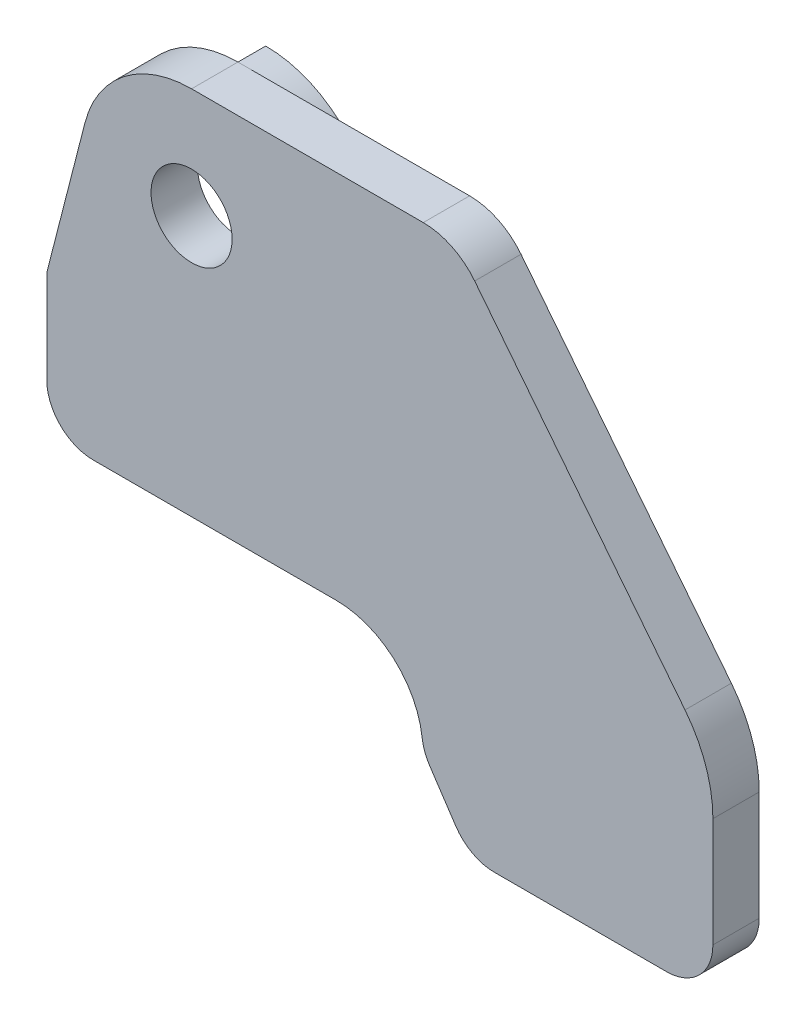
ISO-10303-21;
HEADER;
FILE_DESCRIPTION(('STEP AP214'),'2;1');
FILE_NAME('part.step','',(''),(''),'','','');
FILE_SCHEMA(('AUTOMOTIVE_DESIGN { 1 0 10303 214 1 1 1 1 }'));
ENDSEC;
DATA;
#1=APPLICATION_CONTEXT('core data for automotive mechanical design processes');
#2=APPLICATION_PROTOCOL_DEFINITION('international standard','automotive_design',2000,#1);
#3=PRODUCT_CONTEXT('',#1,'mechanical');
#4=PRODUCT('Part','Part','',(#3));
#5=PRODUCT_RELATED_PRODUCT_CATEGORY('part','',(#4));
#6=PRODUCT_DEFINITION_FORMATION('','',#4);
#7=PRODUCT_DEFINITION_CONTEXT('part definition',#1,'design');
#8=PRODUCT_DEFINITION('design','',#6,#7);
#9=PRODUCT_DEFINITION_SHAPE('','',#8);
#10=(LENGTH_UNIT() NAMED_UNIT(*) SI_UNIT(.MILLI.,.METRE.));
#11=(NAMED_UNIT(*) PLANE_ANGLE_UNIT() SI_UNIT($,.RADIAN.));
#12=(NAMED_UNIT(*) SI_UNIT($,.STERADIAN.) SOLID_ANGLE_UNIT());
#13=UNCERTAINTY_MEASURE_WITH_UNIT(LENGTH_MEASURE(1.E-05),#10,'distance_accuracy_value','');
#14=(GEOMETRIC_REPRESENTATION_CONTEXT(3) GLOBAL_UNCERTAINTY_ASSIGNED_CONTEXT((#13)) GLOBAL_UNIT_ASSIGNED_CONTEXT((#10,
#11,#12)) REPRESENTATION_CONTEXT('',''));
#15=CARTESIAN_POINT('',(0.,0.,0.));
#16=DIRECTION('',(0.,0.,1.));
#17=DIRECTION('',(1.,0.,0.));
#18=AXIS2_PLACEMENT_3D('',#15,#16,#17);
#19=CARTESIAN_POINT('',(0.,0.,2.54));
#20=DIRECTION('',(0.,0.,-1.));
#21=DIRECTION('',(-1.,0.,0.));
#22=AXIS2_PLACEMENT_3D('',#19,#20,#21);
#23=PLANE('',#22);
#24=DIRECTION('',(0.,-1.,0.));
#25=VECTOR('',#24,1.);
#26=CARTESIAN_POINT('',(-7.9375,-6.66373533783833,2.54));
#27=LINE('',#26,#25);
#28=CARTESIAN_POINT('',(-7.9375,-6.66373533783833,2.54));
#29=VERTEX_POINT('',#28);
#30=CARTESIAN_POINT('',(-7.9375,-11.7437353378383,2.54));
#31=VERTEX_POINT('',#30);
#32=EDGE_CURVE('E206',#29,#31,#27,.T.);
#33=ORIENTED_EDGE('',*,*,#32,.T.);
#34=CARTESIAN_POINT('',(-5.3975,-11.7437353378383,2.54));
#35=DIRECTION('',(0.,0.,-1.));
#36=DIRECTION('',(-1.,0.,0.));
#37=AXIS2_PLACEMENT_3D('',#34,#35,#36);
#38=CIRCLE('',#37,2.54);
#39=CARTESIAN_POINT('',(-5.3975,-14.2837353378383,2.54));
#40=VERTEX_POINT('',#39);
#41=EDGE_CURVE('E301',#31,#40,#38,.F.);
#42=ORIENTED_EDGE('',*,*,#41,.T.);
#43=DIRECTION('',(1.,0.,0.));
#44=VECTOR('',#43,1.);
#45=CARTESIAN_POINT('',(-7.9375,-14.2837353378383,2.54));
#46=LINE('',#45,#44);
#47=CARTESIAN_POINT('',(7.9375,-14.2837353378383,2.54));
#48=VERTEX_POINT('',#47);
#49=EDGE_CURVE('E209',#40,#48,#46,.T.);
#50=ORIENTED_EDGE('',*,*,#49,.T.);
#51=CARTESIAN_POINT('',(7.9375,-19.0202003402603,2.54));
#52=DIRECTION('',(0.,0.,-1.));
#53=DIRECTION('',(1.,0.,0.));
#54=AXIS2_PLACEMENT_3D('',#51,#52,#53);
#55=CIRCLE('',#54,4.73646500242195);
#56=CARTESIAN_POINT('',(12.6412554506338,-18.4645157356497,2.54));
#57=VERTEX_POINT('',#56);
#58=EDGE_CURVE('E211',#48,#57,#55,.T.);
#59=ORIENTED_EDGE('',*,*,#58,.T.);
#60=CARTESIAN_POINT('',(15.1637144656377,-18.1665215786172,2.54));
#61=DIRECTION('',(0.,0.,-1.));
#62=DIRECTION('',(-1.,0.,0.));
#63=AXIS2_PLACEMENT_3D('',#60,#61,#62);
#64=CIRCLE('',#63,2.54);
#65=CARTESIAN_POINT('',(13.0503067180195,-19.5754600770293,2.54));
#66=VERTEX_POINT('',#65);
#67=EDGE_CURVE('E295',#57,#66,#64,.F.);
#68=ORIENTED_EDGE('',*,*,#67,.T.);
#69=DIRECTION('',(0.55470019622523,-0.832050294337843,0.));
#70=VECTOR('',#69,1.);
#71=CARTESIAN_POINT('',(15.24,-22.86,2.54));
#72=LINE('',#71,#70);
#73=CARTESIAN_POINT('',(14.4859589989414,-21.7289384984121,2.54));
#74=VERTEX_POINT('',#73);
#75=EDGE_CURVE('E214',#66,#74,#72,.T.);
#76=ORIENTED_EDGE('',*,*,#75,.T.);
#77=CARTESIAN_POINT('',(16.5993667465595,-20.32,2.54));
#78=DIRECTION('',(0.,0.,-1.));
#79=DIRECTION('',(-1.,0.,0.));
#80=AXIS2_PLACEMENT_3D('',#77,#78,#79);
#81=CIRCLE('',#80,2.54);
#82=CARTESIAN_POINT('',(16.5993667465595,-22.86,2.54));
#83=VERTEX_POINT('',#82);
#84=EDGE_CURVE('E297',#74,#83,#81,.F.);
#85=ORIENTED_EDGE('',*,*,#84,.T.);
#86=DIRECTION('',(1.,0.,0.));
#87=VECTOR('',#86,1.);
#88=CARTESIAN_POINT('',(28.575,-22.86,2.54));
#89=LINE('',#88,#87);
#90=CARTESIAN_POINT('',(26.035,-22.86,2.54));
#91=VERTEX_POINT('',#90);
#92=EDGE_CURVE('E217',#83,#91,#89,.T.);
#93=ORIENTED_EDGE('',*,*,#92,.T.);
#94=CARTESIAN_POINT('',(26.035,-20.32,2.54));
#95=DIRECTION('',(0.,0.,-1.));
#96=DIRECTION('',(-1.,0.,0.));
#97=AXIS2_PLACEMENT_3D('',#94,#95,#96);
#98=CIRCLE('',#97,2.54);
#99=CARTESIAN_POINT('',(28.575,-20.32,2.54));
#100=VERTEX_POINT('',#99);
#101=EDGE_CURVE('E299',#91,#100,#98,.F.);
#102=ORIENTED_EDGE('',*,*,#101,.T.);
#103=DIRECTION('',(0.,1.,0.));
#104=VECTOR('',#103,1.);
#105=CARTESIAN_POINT('',(28.575,-14.3271596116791,2.54));
#106=LINE('',#105,#104);
#107=CARTESIAN_POINT('',(28.575,-14.3271596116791,2.54));
#108=VERTEX_POINT('',#107);
#109=EDGE_CURVE('E220',#100,#108,#106,.T.);
#110=ORIENTED_EDGE('',*,*,#109,.T.);
#111=CARTESIAN_POINT('',(21.4793651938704,-14.3271596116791,2.54));
#112=DIRECTION('',(0.,0.,1.));
#113=DIRECTION('',(-1.,0.,0.));
#114=AXIS2_PLACEMENT_3D('',#111,#112,#113);
#115=CIRCLE('',#114,7.09563480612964);
#116=CARTESIAN_POINT('',(27.0474761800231,-9.92895846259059,2.54));
#117=VERTEX_POINT('',#116);
#118=EDGE_CURVE('E222',#108,#117,#115,.T.);
#119=ORIENTED_EDGE('',*,*,#118,.T.);
#120=DIRECTION('',(-0.619846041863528,0.784723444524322,0.));
#121=VECTOR('',#120,1.);
#122=CARTESIAN_POINT('',(15.5179856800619,4.6673459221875,2.54));
#123=LINE('',#122,#121);
#124=CARTESIAN_POINT('',(15.5179856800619,4.6673459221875,2.54));
#125=VERTEX_POINT('',#124);
#126=EDGE_CURVE('E224',#117,#125,#123,.T.);
#127=ORIENTED_EDGE('',*,*,#126,.T.);
#128=CARTESIAN_POINT('',(12.7,2.44144419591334,2.54));
#129=DIRECTION('',(0.,0.,1.));
#130=DIRECTION('',(-1.,0.,0.));
#131=AXIS2_PLACEMENT_3D('',#128,#129,#130);
#132=CIRCLE('',#131,3.59105580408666);
#133=CARTESIAN_POINT('',(12.7,6.0325,2.54));
#134=VERTEX_POINT('',#133);
#135=EDGE_CURVE('E226',#125,#134,#132,.T.);
#136=ORIENTED_EDGE('',*,*,#135,.T.);
#137=DIRECTION('',(-1.,0.,0.));
#138=VECTOR('',#137,1.);
#139=CARTESIAN_POINT('',(0.,6.0325,2.54));
#140=LINE('',#139,#138);
#141=CARTESIAN_POINT('',(0.,6.0325,2.54));
#142=VERTEX_POINT('',#141);
#143=EDGE_CURVE('E228',#134,#142,#140,.T.);
#144=ORIENTED_EDGE('',*,*,#143,.T.);
#145=CARTESIAN_POINT('',(0.,0.,2.54));
#146=DIRECTION('',(0.,0.,1.));
#147=DIRECTION('',(-1.,0.,0.));
#148=AXIS2_PLACEMENT_3D('',#145,#146,#147);
#149=CIRCLE('',#148,6.0325);
#150=CARTESIAN_POINT('',(-5.84325813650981,1.49912994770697,2.54));
#151=VERTEX_POINT('',#150);
#152=EDGE_CURVE('E200',#142,#151,#149,.T.);
#153=ORIENTED_EDGE('',*,*,#152,.T.);
#154=DIRECTION('',(-0.248508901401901,-0.968629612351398,0.));
#155=VECTOR('',#154,1.);
#156=CARTESIAN_POINT('',(-5.84325813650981,1.49912994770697,2.54));
#157=LINE('',#156,#155);
#158=EDGE_CURVE('E203',#151,#29,#157,.T.);
#159=ORIENTED_EDGE('',*,*,#158,.T.);
#160=EDGE_LOOP('',(#33,#42,#50,#59,#68,#76,#85,#93,#102,#110,#119,#127,#136,#144,#153,#159));
#161=FACE_BOUND('',#160,.T.);
#162=CARTESIAN_POINT('',(0.,0.,2.54));
#163=DIRECTION('',(0.,0.,1.));
#164=DIRECTION('',(1.,0.,0.));
#165=AXIS2_PLACEMENT_3D('',#162,#163,#164);
#166=CIRCLE('',#165,2.2225);
#167=CARTESIAN_POINT('',(2.2225,0.,2.54));
#168=VERTEX_POINT('',#167);
#169=EDGE_CURVE('E191',#168,#168,#166,.T.);
#170=ORIENTED_EDGE('',*,*,#169,.F.);
#171=EDGE_LOOP('',(#170));
#172=FACE_BOUND('',#171,.T.);
#173=ADVANCED_FACE('F33',(#161,#172),#23,.F.);
#174=CARTESIAN_POINT('',(0.,0.,0.));
#175=DIRECTION('',(0.,0.,-1.));
#176=DIRECTION('',(-1.,0.,0.));
#177=AXIS2_PLACEMENT_3D('',#174,#175,#176);
#178=PLANE('',#177);
#179=CARTESIAN_POINT('',(0.,0.,0.));
#180=DIRECTION('',(0.,0.,-1.));
#181=DIRECTION('',(1.,0.,0.));
#182=AXIS2_PLACEMENT_3D('',#179,#180,#181);
#183=CIRCLE('',#182,6.0325);
#184=CARTESIAN_POINT('',(0.,6.0325,0.));
#185=VERTEX_POINT('',#184);
#186=CARTESIAN_POINT('',(6.00536793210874,0.571499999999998,0.));
#187=VERTEX_POINT('',#186);
#188=EDGE_CURVE('E187',#185,#187,#183,.T.);
#189=ORIENTED_EDGE('',*,*,#188,.F.);
#190=DIRECTION('',(-1.,0.,0.));
#191=VECTOR('',#190,1.);
#192=CARTESIAN_POINT('',(0.,6.0325,0.));
#193=LINE('',#192,#191);
#194=CARTESIAN_POINT('',(12.7,6.0325,0.));
#195=VERTEX_POINT('',#194);
#196=EDGE_CURVE('E204',#195,#185,#193,.T.);
#197=ORIENTED_EDGE('',*,*,#196,.F.);
#198=CARTESIAN_POINT('',(12.7,2.44144419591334,0.));
#199=DIRECTION('',(0.,0.,1.));
#200=DIRECTION('',(-1.,0.,0.));
#201=AXIS2_PLACEMENT_3D('',#198,#199,#200);
#202=CIRCLE('',#201,3.59105580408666);
#203=CARTESIAN_POINT('',(15.5179856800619,4.6673459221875,0.));
#204=VERTEX_POINT('',#203);
#205=EDGE_CURVE('E255',#204,#195,#202,.T.);
#206=ORIENTED_EDGE('',*,*,#205,.F.);
#207=DIRECTION('',(-0.619846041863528,0.784723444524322,0.));
#208=VECTOR('',#207,1.);
#209=CARTESIAN_POINT('',(15.5179856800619,4.6673459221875,0.));
#210=LINE('',#209,#208);
#211=CARTESIAN_POINT('',(27.0474761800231,-9.92895846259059,0.));
#212=VERTEX_POINT('',#211);
#213=EDGE_CURVE('E253',#212,#204,#210,.T.);
#214=ORIENTED_EDGE('',*,*,#213,.F.);
#215=CARTESIAN_POINT('',(21.4793651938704,-14.3271596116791,0.));
#216=DIRECTION('',(0.,0.,1.));
#217=DIRECTION('',(-1.,0.,0.));
#218=AXIS2_PLACEMENT_3D('',#215,#216,#217);
#219=CIRCLE('',#218,7.09563480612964);
#220=CARTESIAN_POINT('',(28.575,-14.3271596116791,0.));
#221=VERTEX_POINT('',#220);
#222=EDGE_CURVE('E251',#221,#212,#219,.T.);
#223=ORIENTED_EDGE('',*,*,#222,.F.);
#224=DIRECTION('',(0.,1.,0.));
#225=VECTOR('',#224,1.);
#226=CARTESIAN_POINT('',(28.575,-14.3271596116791,0.));
#227=LINE('',#226,#225);
#228=CARTESIAN_POINT('',(28.575,-20.32,0.));
#229=VERTEX_POINT('',#228);
#230=EDGE_CURVE('E249',#229,#221,#227,.T.);
#231=ORIENTED_EDGE('',*,*,#230,.F.);
#232=CARTESIAN_POINT('',(26.035,-20.32,0.));
#233=DIRECTION('',(0.,0.,-1.));
#234=DIRECTION('',(-1.,0.,0.));
#235=AXIS2_PLACEMENT_3D('',#232,#233,#234);
#236=CIRCLE('',#235,2.54);
#237=CARTESIAN_POINT('',(26.035,-22.86,0.));
#238=VERTEX_POINT('',#237);
#239=EDGE_CURVE('E289',#229,#238,#236,.T.);
#240=ORIENTED_EDGE('',*,*,#239,.T.);
#241=DIRECTION('',(1.,0.,0.));
#242=VECTOR('',#241,1.);
#243=CARTESIAN_POINT('',(28.575,-22.86,0.));
#244=LINE('',#243,#242);
#245=CARTESIAN_POINT('',(16.5993667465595,-22.86,0.));
#246=VERTEX_POINT('',#245);
#247=EDGE_CURVE('E246',#246,#238,#244,.T.);
#248=ORIENTED_EDGE('',*,*,#247,.F.);
#249=CARTESIAN_POINT('',(16.5993667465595,-20.32,0.));
#250=DIRECTION('',(0.,0.,-1.));
#251=DIRECTION('',(-1.,0.,0.));
#252=AXIS2_PLACEMENT_3D('',#249,#250,#251);
#253=CIRCLE('',#252,2.54);
#254=CARTESIAN_POINT('',(14.4859589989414,-21.7289384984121,0.));
#255=VERTEX_POINT('',#254);
#256=EDGE_CURVE('E287',#246,#255,#253,.T.);
#257=ORIENTED_EDGE('',*,*,#256,.T.);
#258=DIRECTION('',(0.55470019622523,-0.832050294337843,0.));
#259=VECTOR('',#258,1.);
#260=CARTESIAN_POINT('',(15.24,-22.86,0.));
#261=LINE('',#260,#259);
#262=CARTESIAN_POINT('',(13.0503067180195,-19.5754600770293,0.));
#263=VERTEX_POINT('',#262);
#264=EDGE_CURVE('E243',#263,#255,#261,.T.);
#265=ORIENTED_EDGE('',*,*,#264,.F.);
#266=CARTESIAN_POINT('',(15.1637144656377,-18.1665215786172,0.));
#267=DIRECTION('',(0.,0.,-1.));
#268=DIRECTION('',(-1.,0.,0.));
#269=AXIS2_PLACEMENT_3D('',#266,#267,#268);
#270=CIRCLE('',#269,2.54);
#271=CARTESIAN_POINT('',(12.6412554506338,-18.4645157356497,0.));
#272=VERTEX_POINT('',#271);
#273=EDGE_CURVE('E285',#263,#272,#270,.T.);
#274=ORIENTED_EDGE('',*,*,#273,.T.);
#275=CARTESIAN_POINT('',(7.9375,-19.0202003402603,0.));
#276=DIRECTION('',(0.,0.,-1.));
#277=DIRECTION('',(1.,0.,0.));
#278=AXIS2_PLACEMENT_3D('',#275,#276,#277);
#279=CIRCLE('',#278,4.73646500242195);
#280=CARTESIAN_POINT('',(7.9375,-14.2837353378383,0.));
#281=VERTEX_POINT('',#280);
#282=EDGE_CURVE('E240',#281,#272,#279,.T.);
#283=ORIENTED_EDGE('',*,*,#282,.F.);
#284=DIRECTION('',(1.,0.,0.));
#285=VECTOR('',#284,1.);
#286=CARTESIAN_POINT('',(-7.9375,-14.2837353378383,0.));
#287=LINE('',#286,#285);
#288=CARTESIAN_POINT('',(-5.3975,-14.2837353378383,0.));
#289=VERTEX_POINT('',#288);
#290=EDGE_CURVE('E238',#289,#281,#287,.T.);
#291=ORIENTED_EDGE('',*,*,#290,.F.);
#292=CARTESIAN_POINT('',(-5.3975,-11.7437353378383,0.));
#293=DIRECTION('',(0.,0.,-1.));
#294=DIRECTION('',(-1.,0.,0.));
#295=AXIS2_PLACEMENT_3D('',#292,#293,#294);
#296=CIRCLE('',#295,2.54);
#297=CARTESIAN_POINT('',(-7.9375,-11.7437353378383,0.));
#298=VERTEX_POINT('',#297);
#299=EDGE_CURVE('E291',#289,#298,#296,.T.);
#300=ORIENTED_EDGE('',*,*,#299,.T.);
#301=DIRECTION('',(0.,-1.,0.));
#302=VECTOR('',#301,1.);
#303=CARTESIAN_POINT('',(-7.9375,-6.66373533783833,0.));
#304=LINE('',#303,#302);
#305=CARTESIAN_POINT('',(-7.9375,-6.66373533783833,0.));
#306=VERTEX_POINT('',#305);
#307=EDGE_CURVE('E235',#306,#298,#304,.T.);
#308=ORIENTED_EDGE('',*,*,#307,.F.);
#309=DIRECTION('',(-0.248508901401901,-0.968629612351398,0.));
#310=VECTOR('',#309,1.);
#311=CARTESIAN_POINT('',(-5.84325813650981,1.49912994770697,0.));
#312=LINE('',#311,#310);
#313=CARTESIAN_POINT('',(-5.84325813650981,1.49912994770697,0.));
#314=VERTEX_POINT('',#313);
#315=EDGE_CURVE('E233',#314,#306,#312,.T.);
#316=ORIENTED_EDGE('',*,*,#315,.F.);
#317=CARTESIAN_POINT('',(0.,0.,0.));
#318=DIRECTION('',(0.,0.,1.));
#319=DIRECTION('',(-1.,0.,0.));
#320=AXIS2_PLACEMENT_3D('',#317,#318,#319);
#321=CIRCLE('',#320,6.0325);
#322=EDGE_CURVE('E198',#185,#314,#321,.T.);
#323=ORIENTED_EDGE('',*,*,#322,.F.);
#324=DIRECTION('',(0.,1.,0.));
#325=VECTOR('',#324,1.);
#326=CARTESIAN_POINT('',(0.,6.0325,0.));
#327=LINE('',#326,#325);
#328=CARTESIAN_POINT('',(0.,3.26563206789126,0.));
#329=VERTEX_POINT('',#328);
#330=EDGE_CURVE('E48',#329,#185,#327,.T.);
#331=ORIENTED_EDGE('',*,*,#330,.F.);
#332=CARTESIAN_POINT('',(0.0437653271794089,0.0247438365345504,0.));
#333=DIRECTION('',(0.,0.,1.));
#334=DIRECTION('',(-1.,0.,0.));
#335=AXIS2_PLACEMENT_3D('',#332,#333,#334);
#336=CIRCLE('',#335,3.24118372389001);
#337=CARTESIAN_POINT('',(3.2385,0.571499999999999,0.));
#338=VERTEX_POINT('',#337);
#339=EDGE_CURVE('E515',#338,#329,#336,.T.);
#340=ORIENTED_EDGE('',*,*,#339,.F.);
#341=DIRECTION('',(-1.,0.,0.));
#342=VECTOR('',#341,1.);
#343=CARTESIAN_POINT('',(3.2385,0.571499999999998,0.));
#344=LINE('',#343,#342);
#345=EDGE_CURVE('E54',#187,#338,#344,.T.);
#346=ORIENTED_EDGE('',*,*,#345,.F.);
#347=EDGE_LOOP('',(#189,#197,#206,#214,#223,#231,#240,#248,#257,#265,#274,#283,#291,#300,#308,
#316,#323,#331,#340,#346));
#348=FACE_BOUND('',#347,.T.);
#349=CARTESIAN_POINT('',(0.,0.,0.));
#350=DIRECTION('',(0.,0.,1.));
#351=DIRECTION('',(1.,0.,0.));
#352=AXIS2_PLACEMENT_3D('',#349,#350,#351);
#353=CIRCLE('',#352,2.2225);
#354=CARTESIAN_POINT('',(2.2225,0.,0.));
#355=VERTEX_POINT('',#354);
#356=EDGE_CURVE('E188',#355,#355,#353,.T.);
#357=ORIENTED_EDGE('',*,*,#356,.T.);
#358=EDGE_LOOP('',(#357));
#359=FACE_BOUND('',#358,.T.);
#360=ADVANCED_FACE('F331',(#348,#359),#178,.T.);
#361=CARTESIAN_POINT('',(0.,0.,2.54));
#362=DIRECTION('',(0.,0.,-1.));
#363=DIRECTION('',(-1.,0.,0.));
#364=AXIS2_PLACEMENT_3D('',#361,#362,#363);
#365=CYLINDRICAL_SURFACE('',#364,6.0325);
#366=ORIENTED_EDGE('',*,*,#322,.T.);
#367=DIRECTION('',(0.,0.,-1.));
#368=VECTOR('',#367,1.);
#369=CARTESIAN_POINT('',(-5.84325813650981,1.49912994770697,2.54));
#370=LINE('',#369,#368);
#371=EDGE_CURVE('E279',#151,#314,#370,.T.);
#372=ORIENTED_EDGE('',*,*,#371,.F.);
#373=ORIENTED_EDGE('',*,*,#152,.F.);
#374=DIRECTION('',(0.,0.,-1.));
#375=VECTOR('',#374,1.);
#376=CARTESIAN_POINT('',(0.,6.0325,2.54));
#377=LINE('',#376,#375);
#378=EDGE_CURVE('E230',#142,#185,#377,.T.);
#379=ORIENTED_EDGE('',*,*,#378,.T.);
#380=EDGE_LOOP('',(#366,#372,#373,#379));
#381=FACE_BOUND('',#380,.T.);
#382=ADVANCED_FACE('F365',(#381),#365,.T.);
#383=CARTESIAN_POINT('',(-5.84325813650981,1.49912994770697,2.54));
#384=DIRECTION('',(0.968629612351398,-0.248508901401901,0.));
#385=DIRECTION('',(0.248508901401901,0.968629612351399,0.));
#386=AXIS2_PLACEMENT_3D('',#383,#384,#385);
#387=PLANE('',#386);
#388=ORIENTED_EDGE('',*,*,#315,.T.);
#389=DIRECTION('',(0.,0.,-1.));
#390=VECTOR('',#389,1.);
#391=CARTESIAN_POINT('',(-7.9375,-6.66373533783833,2.54));
#392=LINE('',#391,#390);
#393=EDGE_CURVE('E276',#29,#306,#392,.T.);
#394=ORIENTED_EDGE('',*,*,#393,.F.);
#395=ORIENTED_EDGE('',*,*,#158,.F.);
#396=ORIENTED_EDGE('',*,*,#371,.T.);
#397=EDGE_LOOP('',(#388,#394,#395,#396));
#398=FACE_BOUND('',#397,.T.);
#399=ADVANCED_FACE('F367',(#398),#387,.F.);
#400=CARTESIAN_POINT('',(-7.9375,-6.66373533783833,2.54));
#401=DIRECTION('',(1.,0.,0.));
#402=DIRECTION('',(0.,0.,-1.));
#403=AXIS2_PLACEMENT_3D('',#400,#401,#402);
#404=PLANE('',#403);
#405=ORIENTED_EDGE('',*,*,#307,.T.);
#406=DIRECTION('',(0.,0.,-1.));
#407=VECTOR('',#406,1.);
#408=CARTESIAN_POINT('',(-7.9375,-11.7437353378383,2.54));
#409=LINE('',#408,#407);
#410=EDGE_CURVE('E293',#298,#31,#409,.F.);
#411=ORIENTED_EDGE('',*,*,#410,.T.);
#412=ORIENTED_EDGE('',*,*,#32,.F.);
#413=ORIENTED_EDGE('',*,*,#393,.T.);
#414=EDGE_LOOP('',(#405,#411,#412,#413));
#415=FACE_BOUND('',#414,.T.);
#416=ADVANCED_FACE('F421',(#415),#404,.F.);
#417=CARTESIAN_POINT('',(-7.9375,-14.2837353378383,2.54));
#418=DIRECTION('',(0.,1.,0.));
#419=DIRECTION('',(0.,0.,1.));
#420=AXIS2_PLACEMENT_3D('',#417,#418,#419);
#421=PLANE('',#420);
#422=ORIENTED_EDGE('',*,*,#49,.F.);
#423=DIRECTION('',(0.,0.,-1.));
#424=VECTOR('',#423,1.);
#425=CARTESIAN_POINT('',(-5.3975,-14.2837353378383,2.54));
#426=LINE('',#425,#424);
#427=EDGE_CURVE('E282',#40,#289,#426,.T.);
#428=ORIENTED_EDGE('',*,*,#427,.T.);
#429=ORIENTED_EDGE('',*,*,#290,.T.);
#430=DIRECTION('',(0.,0.,-1.));
#431=VECTOR('',#430,1.);
#432=CARTESIAN_POINT('',(7.9375,-14.2837353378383,2.54));
#433=LINE('',#432,#431);
#434=EDGE_CURVE('E273',#48,#281,#433,.T.);
#435=ORIENTED_EDGE('',*,*,#434,.F.);
#436=EDGE_LOOP('',(#422,#428,#429,#435));
#437=FACE_BOUND('',#436,.T.);
#438=ADVANCED_FACE('F379',(#437),#421,.F.);
#439=CARTESIAN_POINT('',(7.9375,-19.0202003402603,2.54));
#440=DIRECTION('',(0.,0.,-1.));
#441=DIRECTION('',(-1.,0.,0.));
#442=AXIS2_PLACEMENT_3D('',#439,#440,#441);
#443=CYLINDRICAL_SURFACE('',#442,4.73646500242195);
#444=ORIENTED_EDGE('',*,*,#282,.T.);
#445=DIRECTION('',(0.,0.,-1.));
#446=VECTOR('',#445,1.);
#447=CARTESIAN_POINT('',(12.6412554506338,-18.4645157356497,2.54));
#448=LINE('',#447,#446);
#449=EDGE_CURVE('E11',#272,#57,#448,.F.);
#450=ORIENTED_EDGE('',*,*,#449,.T.);
#451=ORIENTED_EDGE('',*,*,#58,.F.);
#452=ORIENTED_EDGE('',*,*,#434,.T.);
#453=EDGE_LOOP('',(#444,#450,#451,#452));
#454=FACE_BOUND('',#453,.T.);
#455=ADVANCED_FACE('F385',(#454),#443,.F.);
#456=CARTESIAN_POINT('',(15.24,-22.86,2.54));
#457=DIRECTION('',(0.832050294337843,0.55470019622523,0.));
#458=DIRECTION('',(-0.55470019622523,0.832050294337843,0.));
#459=AXIS2_PLACEMENT_3D('',#456,#457,#458);
#460=PLANE('',#459);
#461=ORIENTED_EDGE('',*,*,#264,.T.);
#462=DIRECTION('',(0.,0.,-1.));
#463=VECTOR('',#462,1.);
#464=CARTESIAN_POINT('',(14.4859589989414,-21.7289384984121,2.54));
#465=LINE('',#464,#463);
#466=EDGE_CURVE('E41',#255,#74,#465,.F.);
#467=ORIENTED_EDGE('',*,*,#466,.T.);
#468=ORIENTED_EDGE('',*,*,#75,.F.);
#469=DIRECTION('',(0.,0.,-1.));
#470=VECTOR('',#469,1.);
#471=CARTESIAN_POINT('',(13.0503067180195,-19.5754600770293,2.54));
#472=LINE('',#471,#470);
#473=EDGE_CURVE('E311',#66,#263,#472,.T.);
#474=ORIENTED_EDGE('',*,*,#473,.T.);
#475=EDGE_LOOP('',(#461,#467,#468,#474));
#476=FACE_BOUND('',#475,.T.);
#477=ADVANCED_FACE('F316',(#476),#460,.F.);
#478=CARTESIAN_POINT('',(28.575,-22.86,2.54));
#479=DIRECTION('',(0.,1.,0.));
#480=DIRECTION('',(0.,0.,1.));
#481=AXIS2_PLACEMENT_3D('',#478,#479,#480);
#482=PLANE('',#481);
#483=ORIENTED_EDGE('',*,*,#247,.T.);
#484=DIRECTION('',(0.,0.,-1.));
#485=VECTOR('',#484,1.);
#486=CARTESIAN_POINT('',(26.035,-22.86,2.54));
#487=LINE('',#486,#485);
#488=EDGE_CURVE('E309',#238,#91,#487,.F.);
#489=ORIENTED_EDGE('',*,*,#488,.T.);
#490=ORIENTED_EDGE('',*,*,#92,.F.);
#491=DIRECTION('',(0.,0.,-1.));
#492=VECTOR('',#491,1.);
#493=CARTESIAN_POINT('',(16.5993667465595,-22.86,2.54));
#494=LINE('',#493,#492);
#495=EDGE_CURVE('E306',#83,#246,#494,.T.);
#496=ORIENTED_EDGE('',*,*,#495,.T.);
#497=EDGE_LOOP('',(#483,#489,#490,#496));
#498=FACE_BOUND('',#497,.T.);
#499=ADVANCED_FACE('F329',(#498),#482,.F.);
#500=CARTESIAN_POINT('',(28.575,-14.3271596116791,2.54));
#501=DIRECTION('',(-1.,0.,0.));
#502=DIRECTION('',(0.,0.,1.));
#503=AXIS2_PLACEMENT_3D('',#500,#501,#502);
#504=PLANE('',#503);
#505=ORIENTED_EDGE('',*,*,#109,.F.);
#506=DIRECTION('',(0.,0.,-1.));
#507=VECTOR('',#506,1.);
#508=CARTESIAN_POINT('',(28.575,-20.32,2.54));
#509=LINE('',#508,#507);
#510=EDGE_CURVE('E303',#100,#229,#509,.T.);
#511=ORIENTED_EDGE('',*,*,#510,.T.);
#512=ORIENTED_EDGE('',*,*,#230,.T.);
#513=DIRECTION('',(0.,0.,-1.));
#514=VECTOR('',#513,1.);
#515=CARTESIAN_POINT('',(28.575,-14.3271596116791,2.54));
#516=LINE('',#515,#514);
#517=EDGE_CURVE('E270',#108,#221,#516,.T.);
#518=ORIENTED_EDGE('',*,*,#517,.F.);
#519=EDGE_LOOP('',(#505,#511,#512,#518));
#520=FACE_BOUND('',#519,.T.);
#521=ADVANCED_FACE('F341',(#520),#504,.F.);
#522=CARTESIAN_POINT('',(21.4793651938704,-14.3271596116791,2.54));
#523=DIRECTION('',(0.,0.,-1.));
#524=DIRECTION('',(-1.,0.,0.));
#525=AXIS2_PLACEMENT_3D('',#522,#523,#524);
#526=CYLINDRICAL_SURFACE('',#525,7.09563480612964);
#527=ORIENTED_EDGE('',*,*,#222,.T.);
#528=DIRECTION('',(0.,0.,-1.));
#529=VECTOR('',#528,1.);
#530=CARTESIAN_POINT('',(27.0474761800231,-9.92895846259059,2.54));
#531=LINE('',#530,#529);
#532=EDGE_CURVE('E267',#117,#212,#531,.T.);
#533=ORIENTED_EDGE('',*,*,#532,.F.);
#534=ORIENTED_EDGE('',*,*,#118,.F.);
#535=ORIENTED_EDGE('',*,*,#517,.T.);
#536=EDGE_LOOP('',(#527,#533,#534,#535));
#537=FACE_BOUND('',#536,.T.);
#538=ADVANCED_FACE('F348',(#537),#526,.T.);
#539=CARTESIAN_POINT('',(15.5179856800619,4.6673459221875,2.54));
#540=DIRECTION('',(-0.784723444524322,-0.619846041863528,0.));
#541=DIRECTION('',(0.619846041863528,-0.784723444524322,0.));
#542=AXIS2_PLACEMENT_3D('',#539,#540,#541);
#543=PLANE('',#542);
#544=ORIENTED_EDGE('',*,*,#213,.T.);
#545=DIRECTION('',(0.,0.,-1.));
#546=VECTOR('',#545,1.);
#547=CARTESIAN_POINT('',(15.5179856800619,4.6673459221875,2.54));
#548=LINE('',#547,#546);
#549=EDGE_CURVE('E264',#125,#204,#548,.T.);
#550=ORIENTED_EDGE('',*,*,#549,.F.);
#551=ORIENTED_EDGE('',*,*,#126,.F.);
#552=ORIENTED_EDGE('',*,*,#532,.T.);
#553=EDGE_LOOP('',(#544,#550,#551,#552));
#554=FACE_BOUND('',#553,.T.);
#555=ADVANCED_FACE('F351',(#554),#543,.F.);
#556=CARTESIAN_POINT('',(12.7,2.44144419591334,2.54));
#557=DIRECTION('',(0.,0.,-1.));
#558=DIRECTION('',(-1.,0.,0.));
#559=AXIS2_PLACEMENT_3D('',#556,#557,#558);
#560=CYLINDRICAL_SURFACE('',#559,3.59105580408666);
#561=ORIENTED_EDGE('',*,*,#205,.T.);
#562=DIRECTION('',(0.,0.,-1.));
#563=VECTOR('',#562,1.);
#564=CARTESIAN_POINT('',(12.7,6.0325,2.54));
#565=LINE('',#564,#563);
#566=EDGE_CURVE('E261',#134,#195,#565,.T.);
#567=ORIENTED_EDGE('',*,*,#566,.F.);
#568=ORIENTED_EDGE('',*,*,#135,.F.);
#569=ORIENTED_EDGE('',*,*,#549,.T.);
#570=EDGE_LOOP('',(#561,#567,#568,#569));
#571=FACE_BOUND('',#570,.T.);
#572=ADVANCED_FACE('F356',(#571),#560,.T.);
#573=CARTESIAN_POINT('',(0.,6.0325,2.54));
#574=DIRECTION('',(0.,-1.,0.));
#575=DIRECTION('',(0.,0.,-1.));
#576=AXIS2_PLACEMENT_3D('',#573,#574,#575);
#577=PLANE('',#576);
#578=ORIENTED_EDGE('',*,*,#196,.T.);
#579=ORIENTED_EDGE('',*,*,#378,.F.);
#580=ORIENTED_EDGE('',*,*,#143,.F.);
#581=ORIENTED_EDGE('',*,*,#566,.T.);
#582=EDGE_LOOP('',(#578,#579,#580,#581));
#583=FACE_BOUND('',#582,.T.);
#584=ADVANCED_FACE('F362',(#583),#577,.F.);
#585=CARTESIAN_POINT('',(0.,0.,2.54));
#586=DIRECTION('',(0.,0.,-1.));
#587=DIRECTION('',(-1.,0.,0.));
#588=AXIS2_PLACEMENT_3D('',#585,#586,#587);
#589=CYLINDRICAL_SURFACE('',#588,2.2225);
#590=ORIENTED_EDGE('',*,*,#169,.T.);
#591=EDGE_LOOP('',(#590));
#592=FACE_BOUND('',#591,.T.);
#593=ORIENTED_EDGE('',*,*,#356,.F.);
#594=EDGE_LOOP('',(#593));
#595=FACE_BOUND('',#594,.T.);
#596=ADVANCED_FACE('F401',(#592,#595),#589,.F.);
#597=CARTESIAN_POINT('',(-5.3975,-11.7437353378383,2.54));
#598=DIRECTION('',(0.,0.,-1.));
#599=DIRECTION('',(-1.,0.,0.));
#600=AXIS2_PLACEMENT_3D('',#597,#598,#599);
#601=CYLINDRICAL_SURFACE('',#600,2.54);
#602=ORIENTED_EDGE('',*,*,#41,.F.);
#603=ORIENTED_EDGE('',*,*,#410,.F.);
#604=ORIENTED_EDGE('',*,*,#299,.F.);
#605=ORIENTED_EDGE('',*,*,#427,.F.);
#606=EDGE_LOOP('',(#602,#603,#604,#605));
#607=FACE_BOUND('',#606,.T.);
#608=ADVANCED_FACE('F376',(#607),#601,.T.);
#609=CARTESIAN_POINT('',(26.035,-20.32,2.54));
#610=DIRECTION('',(0.,0.,-1.));
#611=DIRECTION('',(-1.,0.,0.));
#612=AXIS2_PLACEMENT_3D('',#609,#610,#611);
#613=CYLINDRICAL_SURFACE('',#612,2.54);
#614=ORIENTED_EDGE('',*,*,#101,.F.);
#615=ORIENTED_EDGE('',*,*,#488,.F.);
#616=ORIENTED_EDGE('',*,*,#239,.F.);
#617=ORIENTED_EDGE('',*,*,#510,.F.);
#618=EDGE_LOOP('',(#614,#615,#616,#617));
#619=FACE_BOUND('',#618,.T.);
#620=ADVANCED_FACE('F338',(#619),#613,.T.);
#621=CARTESIAN_POINT('',(16.5993667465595,-20.32,2.54));
#622=DIRECTION('',(0.,0.,-1.));
#623=DIRECTION('',(-1.,0.,0.));
#624=AXIS2_PLACEMENT_3D('',#621,#622,#623);
#625=CYLINDRICAL_SURFACE('',#624,2.54);
#626=ORIENTED_EDGE('',*,*,#84,.F.);
#627=ORIENTED_EDGE('',*,*,#466,.F.);
#628=ORIENTED_EDGE('',*,*,#256,.F.);
#629=ORIENTED_EDGE('',*,*,#495,.F.);
#630=EDGE_LOOP('',(#626,#627,#628,#629));
#631=FACE_BOUND('',#630,.T.);
#632=ADVANCED_FACE('F326',(#631),#625,.T.);
#633=CARTESIAN_POINT('',(15.1637144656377,-18.1665215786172,2.54));
#634=DIRECTION('',(0.,0.,-1.));
#635=DIRECTION('',(-1.,0.,0.));
#636=AXIS2_PLACEMENT_3D('',#633,#634,#635);
#637=CYLINDRICAL_SURFACE('',#636,2.54);
#638=ORIENTED_EDGE('',*,*,#67,.F.);
#639=ORIENTED_EDGE('',*,*,#449,.F.);
#640=ORIENTED_EDGE('',*,*,#273,.F.);
#641=ORIENTED_EDGE('',*,*,#473,.F.);
#642=EDGE_LOOP('',(#638,#639,#640,#641));
#643=FACE_BOUND('',#642,.T.);
#644=ADVANCED_FACE('F35',(#643),#637,.T.);
#645=CARTESIAN_POINT('',(0.,0.,-1.524));
#646=DIRECTION('',(0.,0.,1.));
#647=DIRECTION('',(1.,0.,0.));
#648=AXIS2_PLACEMENT_3D('',#645,#646,#647);
#649=CYLINDRICAL_SURFACE('',#648,6.0325);
#650=ORIENTED_EDGE('',*,*,#188,.T.);
#651=DIRECTION('',(0.,0.,1.));
#652=VECTOR('',#651,1.);
#653=CARTESIAN_POINT('',(6.00536793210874,0.571499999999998,-1.524));
#654=LINE('',#653,#652);
#655=CARTESIAN_POINT('',(6.00536793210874,0.571499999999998,-1.524));
#656=VERTEX_POINT('',#655);
#657=EDGE_CURVE('E169',#656,#187,#654,.T.);
#658=ORIENTED_EDGE('',*,*,#657,.F.);
#659=CARTESIAN_POINT('',(0.,0.,-1.524));
#660=DIRECTION('',(0.,0.,-1.));
#661=DIRECTION('',(1.,0.,0.));
#662=AXIS2_PLACEMENT_3D('',#659,#660,#661);
#663=CIRCLE('',#662,6.0325);
#664=CARTESIAN_POINT('',(0.,6.0325,-1.524));
#665=VERTEX_POINT('',#664);
#666=EDGE_CURVE('E176',#665,#656,#663,.T.);
#667=ORIENTED_EDGE('',*,*,#666,.F.);
#668=DIRECTION('',(0.,0.,1.));
#669=VECTOR('',#668,1.);
#670=CARTESIAN_POINT('',(0.,6.0325,-1.524));
#671=LINE('',#670,#669);
#672=EDGE_CURVE('E513',#665,#185,#671,.T.);
#673=ORIENTED_EDGE('',*,*,#672,.T.);
#674=EDGE_LOOP('',(#650,#658,#667,#673));
#675=FACE_BOUND('',#674,.T.);
#676=ADVANCED_FACE('F186',(#675),#649,.T.);
#677=CARTESIAN_POINT('',(3.2385,0.571499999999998,-1.524));
#678=DIRECTION('',(0.,1.,0.));
#679=DIRECTION('',(-1.,0.,0.));
#680=AXIS2_PLACEMENT_3D('',#677,#678,#679);
#681=PLANE('',#680);
#682=ORIENTED_EDGE('',*,*,#345,.T.);
#683=DIRECTION('',(0.,0.,1.));
#684=VECTOR('',#683,1.);
#685=CARTESIAN_POINT('',(3.2385,0.571499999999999,-1.524));
#686=LINE('',#685,#684);
#687=CARTESIAN_POINT('',(3.2385,0.571499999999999,-1.524));
#688=VERTEX_POINT('',#687);
#689=EDGE_CURVE('E172',#688,#338,#686,.T.);
#690=ORIENTED_EDGE('',*,*,#689,.F.);
#691=DIRECTION('',(-1.,0.,0.));
#692=VECTOR('',#691,1.);
#693=CARTESIAN_POINT('',(3.2385,0.571499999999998,-1.524));
#694=LINE('',#693,#692);
#695=EDGE_CURVE('E165',#656,#688,#694,.T.);
#696=ORIENTED_EDGE('',*,*,#695,.F.);
#697=ORIENTED_EDGE('',*,*,#657,.T.);
#698=EDGE_LOOP('',(#682,#690,#696,#697));
#699=FACE_BOUND('',#698,.T.);
#700=ADVANCED_FACE('F167',(#699),#681,.F.);
#701=CARTESIAN_POINT('',(0.0437653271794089,0.0247438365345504,-1.524));
#702=DIRECTION('',(0.,0.,1.));
#703=DIRECTION('',(1.,0.,0.));
#704=AXIS2_PLACEMENT_3D('',#701,#702,#703);
#705=CYLINDRICAL_SURFACE('',#704,3.24118372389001);
#706=ORIENTED_EDGE('',*,*,#339,.T.);
#707=DIRECTION('',(0.,0.,1.));
#708=VECTOR('',#707,1.);
#709=CARTESIAN_POINT('',(0.,3.26563206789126,-1.524));
#710=LINE('',#709,#708);
#711=CARTESIAN_POINT('',(0.,3.26563206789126,-1.524));
#712=VERTEX_POINT('',#711);
#713=EDGE_CURVE('E193',#712,#329,#710,.T.);
#714=ORIENTED_EDGE('',*,*,#713,.F.);
#715=CARTESIAN_POINT('',(0.0437653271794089,0.0247438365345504,-1.524));
#716=DIRECTION('',(0.,0.,1.));
#717=DIRECTION('',(-1.,0.,0.));
#718=AXIS2_PLACEMENT_3D('',#715,#716,#717);
#719=CIRCLE('',#718,3.24118372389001);
#720=EDGE_CURVE('E175',#688,#712,#719,.T.);
#721=ORIENTED_EDGE('',*,*,#720,.F.);
#722=ORIENTED_EDGE('',*,*,#689,.T.);
#723=EDGE_LOOP('',(#706,#714,#721,#722));
#724=FACE_BOUND('',#723,.T.);
#725=ADVANCED_FACE('F481',(#724),#705,.F.);
#726=CARTESIAN_POINT('',(0.,6.0325,-1.524));
#727=DIRECTION('',(1.,0.,0.));
#728=DIRECTION('',(0.,1.,0.));
#729=AXIS2_PLACEMENT_3D('',#726,#727,#728);
#730=PLANE('',#729);
#731=ORIENTED_EDGE('',*,*,#330,.T.);
#732=ORIENTED_EDGE('',*,*,#672,.F.);
#733=DIRECTION('',(0.,1.,0.));
#734=VECTOR('',#733,1.);
#735=CARTESIAN_POINT('',(0.,6.0325,-1.524));
#736=LINE('',#735,#734);
#737=EDGE_CURVE('E181',#712,#665,#736,.T.);
#738=ORIENTED_EDGE('',*,*,#737,.F.);
#739=ORIENTED_EDGE('',*,*,#713,.T.);
#740=EDGE_LOOP('',(#731,#732,#738,#739));
#741=FACE_BOUND('',#740,.T.);
#742=ADVANCED_FACE('F490',(#741),#730,.F.);
#743=CARTESIAN_POINT('',(0.,0.,-1.524));
#744=DIRECTION('',(0.,0.,1.));
#745=DIRECTION('',(1.,0.,0.));
#746=AXIS2_PLACEMENT_3D('',#743,#744,#745);
#747=PLANE('',#746);
#748=ORIENTED_EDGE('',*,*,#666,.T.);
#749=ORIENTED_EDGE('',*,*,#695,.T.);
#750=ORIENTED_EDGE('',*,*,#720,.T.);
#751=ORIENTED_EDGE('',*,*,#737,.T.);
#752=EDGE_LOOP('',(#748,#749,#750,#751));
#753=FACE_BOUND('',#752,.T.);
#754=ADVANCED_FACE('F179',(#753),#747,.F.);
#755=CLOSED_SHELL('',(#173,#360,#382,#399,#416,#438,#455,#477,#499,#521,#538,#555,#572,#584,
#596,#608,#620,#632,#644,#676,#700,#725,#742,#754));
#756=MANIFOLD_SOLID_BREP('B2',#755);
#757=ADVANCED_BREP_SHAPE_REPRESENTATION('',(#18,#756),#14);
#758=SHAPE_DEFINITION_REPRESENTATION(#9,#757);
ENDSEC;
END-ISO-10303-21;
